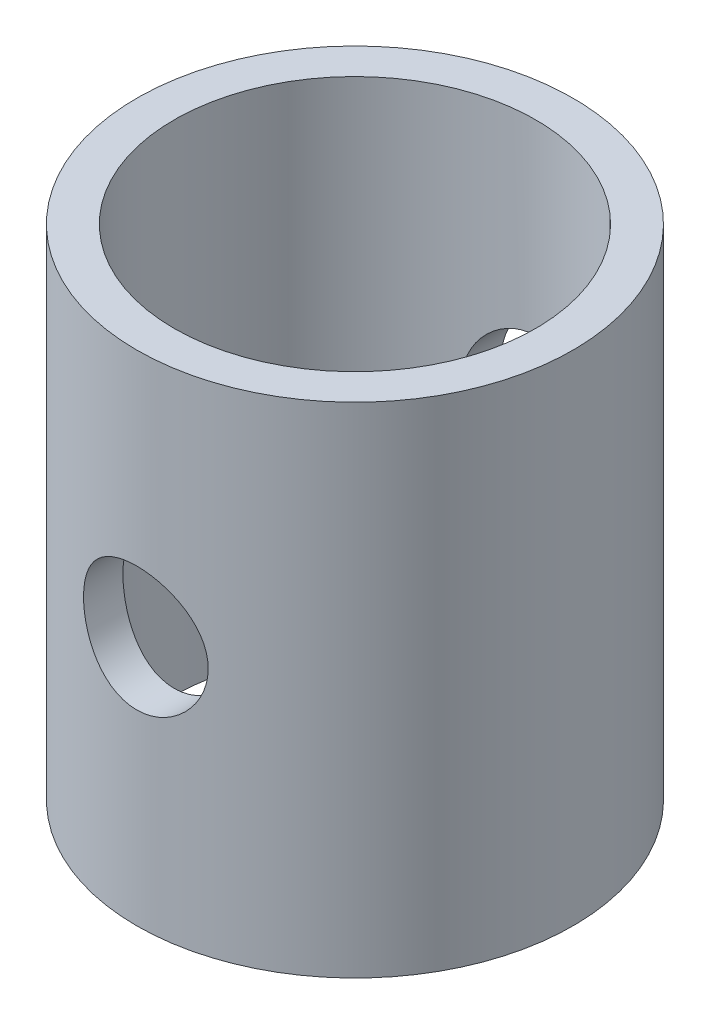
ISO-10303-21;
HEADER;
FILE_DESCRIPTION(('STEP AP214'),'2;1');
FILE_NAME('part.step','',(''),(''),'','','');
FILE_SCHEMA(('AUTOMOTIVE_DESIGN { 1 0 10303 214 1 1 1 1 }'));
ENDSEC;
DATA;
#1=APPLICATION_CONTEXT('core data for automotive mechanical design processes');
#2=APPLICATION_PROTOCOL_DEFINITION('international standard','automotive_design',2000,#1);
#3=PRODUCT_CONTEXT('',#1,'mechanical');
#4=PRODUCT('Part','Part','',(#3));
#5=PRODUCT_RELATED_PRODUCT_CATEGORY('part','',(#4));
#6=PRODUCT_DEFINITION_FORMATION('','',#4);
#7=PRODUCT_DEFINITION_CONTEXT('part definition',#1,'design');
#8=PRODUCT_DEFINITION('design','',#6,#7);
#9=PRODUCT_DEFINITION_SHAPE('','',#8);
#10=(LENGTH_UNIT() NAMED_UNIT(*) SI_UNIT(.MILLI.,.METRE.));
#11=(NAMED_UNIT(*) PLANE_ANGLE_UNIT() SI_UNIT($,.RADIAN.));
#12=(NAMED_UNIT(*) SI_UNIT($,.STERADIAN.) SOLID_ANGLE_UNIT());
#13=UNCERTAINTY_MEASURE_WITH_UNIT(LENGTH_MEASURE(1.E-05),#10,'distance_accuracy_value','');
#14=(GEOMETRIC_REPRESENTATION_CONTEXT(3) GLOBAL_UNCERTAINTY_ASSIGNED_CONTEXT((#13)) GLOBAL_UNIT_ASSIGNED_CONTEXT((#10,
#11,#12)) REPRESENTATION_CONTEXT('',''));
#15=CARTESIAN_POINT('',(0.,0.,0.));
#16=DIRECTION('',(0.,0.,1.));
#17=DIRECTION('',(1.,0.,0.));
#18=AXIS2_PLACEMENT_3D('',#15,#16,#17);
#19=CARTESIAN_POINT('',(0.,20.,0.));
#20=DIRECTION('',(0.,1.,0.));
#21=DIRECTION('',(0.,0.,1.));
#22=AXIS2_PLACEMENT_3D('',#19,#20,#21);
#23=PLANE('',#22);
#24=CARTESIAN_POINT('',(0.,20.,0.));
#25=DIRECTION('',(0.,1.,0.));
#26=DIRECTION('',(0.,0.,1.));
#27=AXIS2_PLACEMENT_3D('',#24,#25,#26);
#28=CIRCLE('',#27,17.5);
#29=CARTESIAN_POINT('',(0.,20.,17.5));
#30=VERTEX_POINT('',#29);
#31=EDGE_CURVE('E10',#30,#30,#28,.T.);
#32=ORIENTED_EDGE('',*,*,#31,.T.);
#33=EDGE_LOOP('',(#32));
#34=FACE_BOUND('',#33,.T.);
#35=CARTESIAN_POINT('',(0.,20.,0.));
#36=DIRECTION('',(0.,1.,0.));
#37=DIRECTION('',(0.,0.,1.));
#38=AXIS2_PLACEMENT_3D('',#35,#36,#37);
#39=CIRCLE('',#38,14.5);
#40=CARTESIAN_POINT('',(0.,20.,14.5));
#41=VERTEX_POINT('',#40);
#42=EDGE_CURVE('E49',#41,#41,#39,.T.);
#43=ORIENTED_EDGE('',*,*,#42,.F.);
#44=EDGE_LOOP('',(#43));
#45=FACE_BOUND('',#44,.T.);
#46=ADVANCED_FACE('F31',(#34,#45),#23,.T.);
#47=CARTESIAN_POINT('',(0.,-20.,0.));
#48=DIRECTION('',(0.,1.,0.));
#49=DIRECTION('',(0.,0.,1.));
#50=AXIS2_PLACEMENT_3D('',#47,#48,#49);
#51=PLANE('',#50);
#52=CARTESIAN_POINT('',(0.,-20.,0.));
#53=DIRECTION('',(0.,1.,0.));
#54=DIRECTION('',(0.,0.,1.));
#55=AXIS2_PLACEMENT_3D('',#52,#53,#54);
#56=CIRCLE('',#55,17.5);
#57=CARTESIAN_POINT('',(0.,-20.,17.5));
#58=VERTEX_POINT('',#57);
#59=EDGE_CURVE('E44',#58,#58,#56,.T.);
#60=ORIENTED_EDGE('',*,*,#59,.F.);
#61=EDGE_LOOP('',(#60));
#62=FACE_BOUND('',#61,.T.);
#63=CARTESIAN_POINT('',(0.,-20.,0.));
#64=DIRECTION('',(0.,1.,0.));
#65=DIRECTION('',(0.,0.,1.));
#66=AXIS2_PLACEMENT_3D('',#63,#64,#65);
#67=CIRCLE('',#66,14.5);
#68=CARTESIAN_POINT('',(0.,-20.,14.5));
#69=VERTEX_POINT('',#68);
#70=EDGE_CURVE('E78',#69,#69,#67,.T.);
#71=ORIENTED_EDGE('',*,*,#70,.T.);
#72=EDGE_LOOP('',(#71));
#73=FACE_BOUND('',#72,.T.);
#74=ADVANCED_FACE('F86',(#62,#73),#51,.F.);
#75=CARTESIAN_POINT('',(0.,20.,0.));
#76=DIRECTION('',(0.,-1.,0.));
#77=DIRECTION('',(0.,0.,-1.));
#78=AXIS2_PLACEMENT_3D('',#75,#76,#77);
#79=CYLINDRICAL_SURFACE('',#78,17.5);
#80=CARTESIAN_POINT('',(0.,5.,-17.5));
#81=CARTESIAN_POINT('',(-0.274887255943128,4.99999515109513,-17.4999967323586));
#82=CARTESIAN_POINT('',(-0.549824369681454,4.97725552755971,-17.4934604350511));
#83=CARTESIAN_POINT('',(-1.09172997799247,4.88708932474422,-17.4680226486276));
#84=CARTESIAN_POINT('',(-1.35869541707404,4.81964583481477,-17.4491164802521));
#85=CARTESIAN_POINT('',(-1.87676075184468,4.64247990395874,-17.4010172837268));
#86=CARTESIAN_POINT('',(-2.12788220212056,4.53281640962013,-17.3718386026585));
#87=CARTESIAN_POINT('',(-2.60817190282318,4.27455502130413,-17.3062494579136));
#88=CARTESIAN_POINT('',(-2.83733785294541,4.12595305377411,-17.2698382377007));
#89=CARTESIAN_POINT('',(-3.27323611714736,3.78991247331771,-17.1926183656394));
#90=CARTESIAN_POINT('',(-3.47930930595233,3.6016381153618,-17.1517260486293));
#91=CARTESIAN_POINT('',(-3.85742839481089,3.19338064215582,-17.0706683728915));
#92=CARTESIAN_POINT('',(-4.02946919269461,2.97339278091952,-17.0305031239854));
#93=CARTESIAN_POINT('',(-4.3379947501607,2.50251604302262,-16.9545753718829));
#94=CARTESIAN_POINT('',(-4.47369552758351,2.25109503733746,-16.9189175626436));
#95=CARTESIAN_POINT('',(-4.7006292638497,1.72781997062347,-16.8572835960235));
#96=CARTESIAN_POINT('',(-4.79187178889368,1.4559703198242,-16.8313053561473));
#97=CARTESIAN_POINT('',(-4.92496082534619,0.906913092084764,-16.7928402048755));
#98=CARTESIAN_POINT('',(-4.9680138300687,0.630021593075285,-16.7800244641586));
#99=CARTESIAN_POINT('',(-5.00726669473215,0.0726721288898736,-16.7683552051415));
#100=CARTESIAN_POINT('',(-5.00347673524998,-0.207785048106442,-16.769498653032));
#101=CARTESIAN_POINT('',(-4.95010336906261,-0.754671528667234,-16.7853258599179));
#102=CARTESIAN_POINT('',(-4.90200814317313,-1.0212608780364,-16.7995695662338));
#103=CARTESIAN_POINT('',(-4.76378465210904,-1.5424180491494,-16.8392837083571));
#104=CARTESIAN_POINT('',(-4.67365258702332,-1.79698478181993,-16.8647551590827));
#105=CARTESIAN_POINT('',(-4.45276702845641,-2.29061561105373,-16.9244215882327));
#106=CARTESIAN_POINT('',(-4.32151377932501,-2.52944268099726,-16.95872291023));
#107=CARTESIAN_POINT('',(-4.02245947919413,-2.98219140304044,-17.0321304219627));
#108=CARTESIAN_POINT('',(-3.85465029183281,-3.19610749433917,-17.0712376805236));
#109=CARTESIAN_POINT('',(-3.47975999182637,-3.60143093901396,-17.151656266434));
#110=CARTESIAN_POINT('',(-3.27143718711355,-3.79168618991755,-17.1929951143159));
#111=CARTESIAN_POINT('',(-2.82533070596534,-4.13481500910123,-17.2719061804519));
#112=CARTESIAN_POINT('',(-2.58754550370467,-4.28768664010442,-17.3094782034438));
#113=CARTESIAN_POINT('',(-2.08730768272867,-4.55232183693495,-17.3769132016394));
#114=CARTESIAN_POINT('',(-1.82472454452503,-4.66385071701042,-17.4067318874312));
#115=CARTESIAN_POINT('',(-1.28348307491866,-4.8408347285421,-17.4549812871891));
#116=CARTESIAN_POINT('',(-1.00482881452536,-4.90630147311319,-17.4734148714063));
#117=CARTESIAN_POINT('',(-0.449165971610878,-4.98743321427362,-17.4963718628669));
#118=CARTESIAN_POINT('',(-0.17240336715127,-5.00466173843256,-17.501331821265));
#119=CARTESIAN_POINT('',(0.380066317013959,-4.9931818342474,-17.4980521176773));
#120=CARTESIAN_POINT('',(0.655773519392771,-4.9644789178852,-17.4898140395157));
#121=CARTESIAN_POINT('',(1.19254658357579,-4.86322388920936,-17.4613481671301));
#122=CARTESIAN_POINT('',(1.45379552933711,-4.79156704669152,-17.4413653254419));
#123=CARTESIAN_POINT('',(1.9605217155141,-4.60749874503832,-17.3916999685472));
#124=CARTESIAN_POINT('',(2.20599712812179,-4.49508257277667,-17.3620163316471));
#125=CARTESIAN_POINT('',(2.68010421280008,-4.22994165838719,-17.2952490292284));
#126=CARTESIAN_POINT('',(2.90825621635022,-4.07639700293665,-17.2580190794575));
#127=CARTESIAN_POINT('',(3.33609632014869,-3.73436873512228,-17.180448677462));
#128=CARTESIAN_POINT('',(3.53577792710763,-3.54587717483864,-17.1401075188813));
#129=CARTESIAN_POINT('',(3.90776607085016,-3.13197664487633,-17.0592154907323));
#130=CARTESIAN_POINT('',(4.07896356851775,-2.90556181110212,-17.0187009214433));
#131=CARTESIAN_POINT('',(4.380988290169,-2.42634352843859,-16.9434723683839));
#132=CARTESIAN_POINT('',(4.51181691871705,-2.17354099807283,-16.9087581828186));
#133=CARTESIAN_POINT('',(4.72843635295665,-1.64977197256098,-16.8494662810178));
#134=CARTESIAN_POINT('',(4.81446583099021,-1.37891059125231,-16.8248350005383));
#135=CARTESIAN_POINT('',(4.93948625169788,-0.825725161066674,-16.7885614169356));
#136=CARTESIAN_POINT('',(4.9784914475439,-0.543404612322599,-16.7769151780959));
#137=CARTESIAN_POINT('',(5.00745060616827,0.0132400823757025,-16.7682925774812));
#138=CARTESIAN_POINT('',(4.99920069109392,0.287463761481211,-16.7707790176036));
#139=CARTESIAN_POINT('',(4.93811777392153,0.830436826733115,-16.7888649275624));
#140=CARTESIAN_POINT('',(4.88528625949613,1.09918639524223,-16.8044639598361));
#141=CARTESIAN_POINT('',(4.73764922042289,1.6209459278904,-16.8466744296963));
#142=CARTESIAN_POINT('',(4.64327729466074,1.87408846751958,-16.8731719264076));
#143=CARTESIAN_POINT('',(4.41557373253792,2.36114683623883,-16.9341825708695));
#144=CARTESIAN_POINT('',(4.28223520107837,2.59505925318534,-16.9686971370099));
#145=CARTESIAN_POINT('',(3.97516366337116,3.04545880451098,-17.0432917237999));
#146=CARTESIAN_POINT('',(3.80023069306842,3.26110347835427,-17.0835190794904));
#147=CARTESIAN_POINT('',(3.41714960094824,3.66055973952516,-17.164246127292));
#148=CARTESIAN_POINT('',(3.20899312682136,3.84436329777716,-17.2047458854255));
#149=CARTESIAN_POINT('',(2.75893580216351,4.17959296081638,-17.282698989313));
#150=CARTESIAN_POINT('',(2.51630625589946,4.33006746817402,-17.3200475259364));
#151=CARTESIAN_POINT('',(2.00812632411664,4.58786446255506,-17.3862848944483));
#152=CARTESIAN_POINT('',(1.74258856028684,4.69521052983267,-17.4151783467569));
#153=CARTESIAN_POINT('',(1.23229078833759,4.85211887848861,-17.4581836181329));
#154=CARTESIAN_POINT('',(0.989407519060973,4.9074338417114,-17.473742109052));
#155=CARTESIAN_POINT('',(0.497695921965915,4.98137414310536,-17.4946510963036));
#156=CARTESIAN_POINT('',(0.248868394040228,5.00000438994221,-17.5000029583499));
#157=CARTESIAN_POINT('',(0.,5.,-17.5));
#158=B_SPLINE_CURVE_WITH_KNOTS('',3,(#80,#81,#82,#83,#84,#85,#86,#87,#88,#89,#90,#91,#92,#93,
#94,#95,#96,#97,#98,#99,#100,#101,#102,#103,#104,#105,#106,#107,#108,#109,#110,#111,#112,#113,
#114,#115,#116,#117,#118,#119,#120,#121,#122,#123,#124,#125,#126,#127,#128,#129,#130,#131,#132,
#133,#134,#135,#136,#137,#138,#139,#140,#141,#142,#143,#144,#145,#146,#147,#148,#149,#150,#151,
#152,#153,#154,#155,#156,#157),.UNSPECIFIED.,.T.,.F.,(4,2,2,2,2,2,2,2,2,2,2,2,2,2,2,2,2,2,2,2,2,
2,2,2,2,2,2,2,2,2,2,2,2,2,2,2,2,2,4),(0.,0.82374828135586,1.64780834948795,2.47072203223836,
3.2937218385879,4.13619528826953,4.97879494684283,5.83832688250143,6.69767378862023,
7.53498774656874,8.37211973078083,9.18211964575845,9.99219279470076,10.8125200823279,
11.6330301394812,12.4844625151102,13.3359390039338,14.1921775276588,15.0482001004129,
15.8761364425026,16.7039734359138,17.5151285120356,18.3263774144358,19.1551881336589,
19.9841875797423,20.840302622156,21.6963878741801,22.5478643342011,23.399082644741,
24.2181670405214,25.0372241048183,25.8479274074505,26.6587742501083,27.4966914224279,
28.3348195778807,29.1944494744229,30.053608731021,30.7994867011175,31.5452648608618),.UNSPECIFIED.);
#159=CARTESIAN_POINT('',(0.,5.,-17.5));
#160=VERTEX_POINT('',#159);
#161=EDGE_CURVE('E73',#160,#160,#158,.T.);
#162=ORIENTED_EDGE('',*,*,#161,.T.);
#163=EDGE_LOOP('',(#162));
#164=FACE_BOUND('',#163,.T.);
#165=CARTESIAN_POINT('',(5.,0.,16.7705098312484));
#166=CARTESIAN_POINT('',(4.99999505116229,-0.274628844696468,16.7705136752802));
#167=CARTESIAN_POINT('',(4.97729666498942,-0.549307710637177,16.7773294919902));
#168=CARTESIAN_POINT('',(4.88730908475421,-1.09067809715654,16.8037597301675));
#169=CARTESIAN_POINT('',(4.82000175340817,-1.35736632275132,16.8233793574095));
#170=CARTESIAN_POINT('',(4.64323358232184,-1.87484300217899,16.8730177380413));
#171=CARTESIAN_POINT('',(4.5338380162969,-2.12565537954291,16.903020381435));
#172=CARTESIAN_POINT('',(4.27620910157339,-2.60541952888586,16.9700230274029));
#173=CARTESIAN_POINT('',(4.12797114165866,-2.83436870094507,17.0070238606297));
#174=CARTESIAN_POINT('',(3.79231200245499,-3.2704789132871,17.0850445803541));
#175=CARTESIAN_POINT('',(3.60397302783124,-3.47691950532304,17.1261438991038));
#176=CARTESIAN_POINT('',(3.19542811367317,-3.85575695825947,17.2070491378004));
#177=CARTESIAN_POINT('',(2.97521844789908,-4.0281498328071,17.2468549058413));
#178=CARTESIAN_POINT('',(2.50411508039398,-4.33707162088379,17.3215833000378));
#179=CARTESIAN_POINT('',(2.25272695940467,-4.47287404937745,17.3564013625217));
#180=CARTESIAN_POINT('',(1.7295211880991,-4.70000443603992,17.4163135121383));
#181=CARTESIAN_POINT('',(1.45770752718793,-4.79134105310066,17.4414094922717));
#182=CARTESIAN_POINT('',(0.908896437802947,-4.92458615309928,17.4784879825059));
#183=CARTESIAN_POINT('',(0.632219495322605,-4.96772255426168,17.4907956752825));
#184=CARTESIAN_POINT('',(0.0753002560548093,-5.00721683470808,17.5020523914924));
#185=CARTESIAN_POINT('',(-0.204941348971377,-5.00358365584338,17.5010039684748));
#186=CARTESIAN_POINT('',(-0.752450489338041,-4.95048406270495,17.4859001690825));
#187=CARTESIAN_POINT('',(-1.01985886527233,-4.9023459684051,17.4722217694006));
#188=CARTESIAN_POINT('',(-1.54263055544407,-4.76376224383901,17.4338471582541));
#189=CARTESIAN_POINT('',(-1.79799313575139,-4.67331403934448,17.4091502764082));
#190=CARTESIAN_POINT('',(-2.29268458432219,-4.45172649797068,17.3509757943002));
#191=CARTESIAN_POINT('',(-2.53180760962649,-4.32015305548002,17.3174051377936));
#192=CARTESIAN_POINT('',(-2.98501810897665,-4.02038853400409,17.2450692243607));
#193=CARTESIAN_POINT('',(-3.19910008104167,-3.85218943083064,17.206302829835));
#194=CARTESIAN_POINT('',(-3.60408162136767,-3.47698572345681,17.126142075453));
#195=CARTESIAN_POINT('',(-3.79390394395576,-3.26882641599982,17.0847032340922));
#196=CARTESIAN_POINT('',(-4.13623253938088,-2.82321227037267,17.0050743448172));
#197=CARTESIAN_POINT('',(-4.28873578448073,-2.58575505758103,16.9668845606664));
#198=CARTESIAN_POINT('',(-4.55308339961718,-2.08567278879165,16.8978793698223));
#199=CARTESIAN_POINT('',(-4.66459344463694,-1.82286193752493,16.8671252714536));
#200=CARTESIAN_POINT('',(-4.84147378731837,-1.28111709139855,16.8172136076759));
#201=CARTESIAN_POINT('',(-4.90685751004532,-1.00218781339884,16.7980526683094));
#202=CARTESIAN_POINT('',(-4.9876854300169,-0.446298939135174,16.7742278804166));
#203=CARTESIAN_POINT('',(-5.00475370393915,-0.169595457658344,16.7690927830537));
#204=CARTESIAN_POINT('',(-4.99297491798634,0.382720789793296,16.772603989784));
#205=CARTESIAN_POINT('',(-4.96413358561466,0.658333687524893,16.7812485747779));
#206=CARTESIAN_POINT('',(-4.86279453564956,1.19410307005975,16.8108857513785));
#207=CARTESIAN_POINT('',(-4.79131155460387,1.45446896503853,16.8315910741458));
#208=CARTESIAN_POINT('',(-4.60787904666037,1.95950467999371,16.8827265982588));
#209=CARTESIAN_POINT('',(-4.4959236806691,2.20417222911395,16.9131582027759));
#210=CARTESIAN_POINT('',(-4.23154912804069,2.67755518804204,16.9812547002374));
#211=CARTESIAN_POINT('',(-4.07819729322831,2.90572611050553,17.0190799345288));
#212=CARTESIAN_POINT('',(-3.73651159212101,3.33369093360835,17.0973431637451));
#213=CARTESIAN_POINT('',(-3.54817014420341,3.53347866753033,17.1377817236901));
#214=CARTESIAN_POINT('',(-3.1342700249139,3.90594854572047,17.2183681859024));
#215=CARTESIAN_POINT('',(-2.90766927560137,4.07748742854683,17.2584601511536));
#216=CARTESIAN_POINT('',(-2.42796326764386,4.38011420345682,17.3324494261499));
#217=CARTESIAN_POINT('',(-2.17485939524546,4.51120420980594,17.3663470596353));
#218=CARTESIAN_POINT('',(-1.65108318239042,4.72796071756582,17.4239126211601));
#219=CARTESIAN_POINT('',(-1.38056199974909,4.8139709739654,17.4476577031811));
#220=CARTESIAN_POINT('',(-0.828114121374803,4.93906700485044,17.4825834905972));
#221=CARTESIAN_POINT('',(-0.546190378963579,4.97816485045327,17.4937674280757));
#222=CARTESIAN_POINT('',(0.0104455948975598,5.00747858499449,17.5021333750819));
#223=CARTESIAN_POINT('',(0.285064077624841,4.99936037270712,17.4997925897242));
#224=CARTESIAN_POINT('',(0.828862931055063,4.9384042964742,17.4824767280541));
#225=CARTESIAN_POINT('',(1.09804356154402,4.88556857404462,17.4675022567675));
#226=CARTESIAN_POINT('',(1.62101033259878,4.73767159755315,17.4267200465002));
#227=CARTESIAN_POINT('',(1.87491258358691,4.64299205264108,17.4010103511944));
#228=CARTESIAN_POINT('',(2.36336800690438,4.41443460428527,17.3414273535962));
#229=CARTESIAN_POINT('',(2.59791817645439,4.28055063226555,17.3075527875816));
#230=CARTESIAN_POINT('',(3.04858364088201,3.97275665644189,17.2339738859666));
#231=CARTESIAN_POINT('',(3.26394332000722,3.79777478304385,17.1941261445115));
#232=CARTESIAN_POINT('',(3.66280305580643,3.41472718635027,17.1136016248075));
#233=CARTESIAN_POINT('',(3.8462942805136,3.20665232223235,17.072924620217));
#234=CARTESIAN_POINT('',(4.18102115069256,2.75675770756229,16.9941009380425));
#235=CARTESIAN_POINT('',(4.33128291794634,2.51419513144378,16.9560487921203));
#236=CARTESIAN_POINT('',(4.58869859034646,2.00619533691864,16.8882111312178));
#237=CARTESIAN_POINT('',(4.69587662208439,1.74077102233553,16.8584209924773));
#238=CARTESIAN_POINT('',(4.85246335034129,1.23086574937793,16.8139614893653));
#239=CARTESIAN_POINT('',(4.90764749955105,0.988274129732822,16.7978109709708));
#240=CARTESIAN_POINT('',(4.98141517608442,0.497134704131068,16.776084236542));
#241=CARTESIAN_POINT('',(5.00000447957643,0.248587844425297,16.7705063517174));
#242=CARTESIAN_POINT('',(5.,0.,16.7705098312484));
#243=B_SPLINE_CURVE_WITH_KNOTS('',3,(#165,#166,#167,#168,#169,#170,#171,#172,#173,#174,#175,
#176,#177,#178,#179,#180,#181,#182,#183,#184,#185,#186,#187,#188,#189,#190,#191,#192,#193,#194,
#195,#196,#197,#198,#199,#200,#201,#202,#203,#204,#205,#206,#207,#208,#209,#210,#211,#212,#213,
#214,#215,#216,#217,#218,#219,#220,#221,#222,#223,#224,#225,#226,#227,#228,#229,#230,#231,#232,
#233,#234,#235,#236,#237,#238,#239,#240,#241,#242),.UNSPECIFIED.,.T.,.F.,(4,2,2,2,2,2,2,2,2,2,2,
2,2,2,2,2,2,2,2,2,2,2,2,2,2,2,2,2,2,2,2,2,2,2,2,2,2,2,4),(0.,0.822970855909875,1.64627652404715,
2.46831045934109,3.29044202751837,4.13392918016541,4.97751503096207,5.83678707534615,
6.69589172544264,7.53257252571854,8.36909336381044,9.18142594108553,9.99380794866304,
10.8150725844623,11.6365173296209,12.486790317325,13.337132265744,14.194263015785,
15.0511441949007,15.8788590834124,16.7064707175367,17.5151322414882,18.3239104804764,
19.152700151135,19.981669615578,20.8386347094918,21.6955550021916,22.5458421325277,
23.3959104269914,24.2161724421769,25.0363951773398,25.8492853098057,26.662301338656,
27.4994942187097,28.3369187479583,29.1963403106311,30.0552799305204,30.8003322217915,
31.5452669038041),.UNSPECIFIED.);
#244=CARTESIAN_POINT('',(5.,0.,16.7705098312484));
#245=VERTEX_POINT('',#244);
#246=EDGE_CURVE('E69',#245,#245,#243,.T.);
#247=ORIENTED_EDGE('',*,*,#246,.T.);
#248=EDGE_LOOP('',(#247));
#249=FACE_BOUND('',#248,.T.);
#250=ORIENTED_EDGE('',*,*,#31,.F.);
#251=EDGE_LOOP('',(#250));
#252=FACE_BOUND('',#251,.T.);
#253=ORIENTED_EDGE('',*,*,#59,.T.);
#254=EDGE_LOOP('',(#253));
#255=FACE_BOUND('',#254,.T.);
#256=ADVANCED_FACE('F33',(#164,#249,#252,#255),#79,.T.);
#257=CARTESIAN_POINT('',(0.,20.,0.));
#258=DIRECTION('',(0.,-1.,0.));
#259=DIRECTION('',(0.,0.,-1.));
#260=AXIS2_PLACEMENT_3D('',#257,#258,#259);
#261=CYLINDRICAL_SURFACE('',#260,14.5);
#262=CARTESIAN_POINT('',(0.,5.,-14.5));
#263=CARTESIAN_POINT('',(-0.272276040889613,5.00000332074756,-14.5000022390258));
#264=CARTESIAN_POINT('',(-0.544528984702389,4.97768822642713,-14.4922612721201));
#265=CARTESIAN_POINT('',(-1.08098398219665,4.88931271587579,-14.4621461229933));
#266=CARTESIAN_POINT('',(-1.34518575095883,4.82325075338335,-14.4397714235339));
#267=CARTESIAN_POINT('',(-1.85772547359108,4.64994088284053,-14.3828127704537));
#268=CARTESIAN_POINT('',(-2.10609017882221,4.54276469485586,-14.3482500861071));
#269=CARTESIAN_POINT('',(-2.58131962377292,4.29059193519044,-14.2704184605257));
#270=CARTESIAN_POINT('',(-2.80817965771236,4.14558711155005,-14.2271476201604));
#271=CARTESIAN_POINT('',(-3.24227336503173,3.81632850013,-14.1346589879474));
#272=CARTESIAN_POINT('',(-3.44860772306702,3.63093347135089,-14.0852916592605));
#273=CARTESIAN_POINT('',(-3.82802367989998,3.22841309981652,-13.986947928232));
#274=CARTESIAN_POINT('',(-4.00109725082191,3.01128011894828,-13.9379716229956));
#275=CARTESIAN_POINT('',(-4.23466620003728,2.66234731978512,-13.8681109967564));
#276=CARTESIAN_POINT('',(-4.3091147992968,2.54009073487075,-13.8451000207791));
#277=CARTESIAN_POINT('',(-4.44739544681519,2.28935315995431,-13.8013017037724));
#278=CARTESIAN_POINT('',(-4.51123171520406,2.16087467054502,-13.7805134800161));
#279=CARTESIAN_POINT('',(-4.62776638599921,1.89852352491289,-13.7418177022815));
#280=CARTESIAN_POINT('',(-4.68046298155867,1.76464999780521,-13.7239106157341));
#281=CARTESIAN_POINT('',(-4.7742048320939,1.49253537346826,-13.6915823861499));
#282=CARTESIAN_POINT('',(-4.81525547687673,1.35429632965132,-13.6771596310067));
#283=CARTESIAN_POINT('',(-4.88408382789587,1.07939281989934,-13.652729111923));
#284=CARTESIAN_POINT('',(-4.91227899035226,0.94284508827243,-13.642583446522));
#285=CARTESIAN_POINT('',(-4.95717772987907,0.667690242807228,-13.626333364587));
#286=CARTESIAN_POINT('',(-4.97388615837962,0.529084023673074,-13.6202272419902));
#287=CARTESIAN_POINT('',(-4.99565258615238,0.250850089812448,-13.6122588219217));
#288=CARTESIAN_POINT('',(-5.00071162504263,0.11122246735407,-13.6103961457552));
#289=CARTESIAN_POINT('',(-4.99912744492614,-0.167954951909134,-13.6109781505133));
#290=CARTESIAN_POINT('',(-4.99248458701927,-0.307504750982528,-13.6134226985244));
#291=CARTESIAN_POINT('',(-4.96818839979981,-0.578520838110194,-13.6223074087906));
#292=CARTESIAN_POINT('',(-4.95109761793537,-0.710044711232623,-13.6285433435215));
#293=CARTESIAN_POINT('',(-4.9065692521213,-0.971146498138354,-13.6446376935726));
#294=CARTESIAN_POINT('',(-4.87912819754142,-1.10072374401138,-13.654497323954));
#295=CARTESIAN_POINT('',(-4.81415116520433,-1.35698559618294,-13.6775412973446));
#296=CARTESIAN_POINT('',(-4.77661796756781,-1.48367098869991,-13.6907247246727));
#297=CARTESIAN_POINT('',(-4.69177720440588,-1.73339178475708,-13.72003033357));
#298=CARTESIAN_POINT('',(-4.6444659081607,-1.85642577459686,-13.7361536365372));
#299=CARTESIAN_POINT('',(-4.48666214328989,-2.22288958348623,-13.7888490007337));
#300=CARTESIAN_POINT('',(-4.36134524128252,-2.45956912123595,-13.8293558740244));
#301=CARTESIAN_POINT('',(-4.07532115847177,-2.90910484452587,-13.9163223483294));
#302=CARTESIAN_POINT('',(-3.91460319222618,-3.12195373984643,-13.9627837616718));
#303=CARTESIAN_POINT('',(-3.55164087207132,-3.53052058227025,-14.0596232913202));
#304=CARTESIAN_POINT('',(-3.34757212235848,-3.72460659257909,-14.1100748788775));
#305=CARTESIAN_POINT('',(-2.90917503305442,-4.07623406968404,-14.2069361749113));
#306=CARTESIAN_POINT('',(-2.67484337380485,-4.23377152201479,-14.2533454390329));
#307=CARTESIAN_POINT('',(-2.17891773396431,-4.50928356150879,-14.3375798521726));
#308=CARTESIAN_POINT('',(-1.91704633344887,-4.62679239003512,-14.3753023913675));
#309=CARTESIAN_POINT('',(-1.37563712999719,-4.81557149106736,-14.437164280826));
#310=CARTESIAN_POINT('',(-1.09610595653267,-4.88685900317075,-14.4613086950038));
#311=CARTESIAN_POINT('',(-0.541123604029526,-4.97821338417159,-14.4924414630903));
#312=CARTESIAN_POINT('',(-0.266076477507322,-5.00048606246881,-14.5001680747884));
#313=CARTESIAN_POINT('',(0.283897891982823,-4.99949805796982,-14.4998264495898));
#314=CARTESIAN_POINT('',(0.558825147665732,-4.97624567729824,-14.4917610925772));
#315=CARTESIAN_POINT('',(1.0917393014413,-4.88659915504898,-14.4612301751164));
#316=CARTESIAN_POINT('',(1.34998705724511,-4.82158289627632,-14.4392248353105));
#317=CARTESIAN_POINT('',(1.85179161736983,-4.65199157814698,-14.3834851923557));
#318=CARTESIAN_POINT('',(2.09534652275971,-4.54741141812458,-14.3497493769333));
#319=CARTESIAN_POINT('',(2.56823537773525,-4.29855141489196,-14.2728125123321));
#320=CARTESIAN_POINT('',(2.79700047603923,-4.15326682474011,-14.2293784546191));
#321=CARTESIAN_POINT('',(3.22769174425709,-3.82815432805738,-14.13791051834));
#322=CARTESIAN_POINT('',(3.42960918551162,-3.64831523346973,-14.0898751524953));
#323=CARTESIAN_POINT('',(3.71327334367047,-3.35136348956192,-14.0168405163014));
#324=CARTESIAN_POINT('',(3.80653976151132,-3.24503766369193,-13.9917382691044));
#325=CARTESIAN_POINT('',(3.98380499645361,-3.02477322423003,-13.9423006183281));
#326=CARTESIAN_POINT('',(4.067807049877,-2.91083729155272,-13.9179649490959));
#327=CARTESIAN_POINT('',(4.2260045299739,-2.67599450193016,-13.8707501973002));
#328=CARTESIAN_POINT('',(4.30019554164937,-2.55508454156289,-13.8478717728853));
#329=CARTESIAN_POINT('',(4.43815222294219,-2.3071452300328,-13.8042760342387));
#330=CARTESIAN_POINT('',(4.50192226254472,-2.1801184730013,-13.783557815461));
#331=CARTESIAN_POINT('',(4.61853752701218,-1.92076109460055,-13.7449222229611));
#332=CARTESIAN_POINT('',(4.67138490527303,-1.78843152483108,-13.727004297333));
#333=CARTESIAN_POINT('',(4.76567488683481,-1.51942314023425,-13.6945547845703));
#334=CARTESIAN_POINT('',(4.80712221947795,-1.38274615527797,-13.6800217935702));
#335=CARTESIAN_POINT('',(4.87822592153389,-1.10603494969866,-13.6548283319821));
#336=CARTESIAN_POINT('',(4.9078846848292,-0.966001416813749,-13.6441670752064));
#337=CARTESIAN_POINT('',(4.95510828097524,-0.683656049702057,-13.6270883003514));
#338=CARTESIAN_POINT('',(4.97267378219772,-0.541344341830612,-13.6206705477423));
#339=CARTESIAN_POINT('',(4.99488920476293,-0.263484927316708,-13.6125387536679));
#340=CARTESIAN_POINT('',(5.00019728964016,-0.127996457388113,-13.610585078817));
#341=CARTESIAN_POINT('',(4.99979144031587,0.14300985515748,-13.6107342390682));
#342=CARTESIAN_POINT('',(4.99407376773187,0.278527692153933,-13.6128384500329));
#343=CARTESIAN_POINT('',(4.97167135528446,0.548469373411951,-13.6210361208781));
#344=CARTESIAN_POINT('',(4.95499149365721,0.682893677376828,-13.627127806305));
#345=CARTESIAN_POINT('',(4.91082799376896,0.949774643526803,-13.6431051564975));
#346=CARTESIAN_POINT('',(4.8833402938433,1.08223054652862,-13.6529922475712));
#347=CARTESIAN_POINT('',(4.81854500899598,1.34128566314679,-13.6759927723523));
#348=CARTESIAN_POINT('',(4.7814691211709,1.46794961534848,-13.6890296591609));
#349=CARTESIAN_POINT('',(4.69755188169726,1.71766819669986,-13.7180526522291));
#350=CARTESIAN_POINT('',(4.65070706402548,1.84072152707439,-13.7340398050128));
#351=CARTESIAN_POINT('',(4.49605471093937,2.20327052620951,-13.7857669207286));
#352=CARTESIAN_POINT('',(4.37407833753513,2.43635717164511,-13.8252915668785));
#353=CARTESIAN_POINT('',(4.08941820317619,2.88993431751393,-13.9122148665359));
#354=CARTESIAN_POINT('',(3.92511672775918,3.10934839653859,-13.9598925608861));
#355=CARTESIAN_POINT('',(3.56309439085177,3.51837325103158,-14.0566506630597));
#356=CARTESIAN_POINT('',(3.3653637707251,3.70797529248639,-14.1057314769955));
#357=CARTESIAN_POINT('',(2.9319584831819,4.06015625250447,-14.2022852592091));
#358=CARTESIAN_POINT('',(2.69502183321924,4.22123087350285,-14.2495994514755));
#359=CARTESIAN_POINT('',(2.19584251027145,4.50112236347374,-14.3350021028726));
#360=CARTESIAN_POINT('',(1.93360420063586,4.61994650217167,-14.3730921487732));
#361=CARTESIAN_POINT('',(1.39697646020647,4.80911875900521,-14.4350190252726));
#362=CARTESIAN_POINT('',(1.12297038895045,4.88045583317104,-14.4591451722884));
#363=CARTESIAN_POINT('',(0.565965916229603,4.97588700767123,-14.4916319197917));
#364=CARTESIAN_POINT('',(0.282970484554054,4.9999965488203,-14.4999976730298));
#365=CARTESIAN_POINT('',(0.,5.,-14.5));
#366=B_SPLINE_CURVE_WITH_KNOTS('',3,(#262,#263,#264,#265,#266,#267,#268,#269,#270,#271,#272,
#273,#274,#275,#276,#277,#278,#279,#280,#281,#282,#283,#284,#285,#286,#287,#288,#289,#290,#291,
#292,#293,#294,#295,#296,#297,#298,#299,#300,#301,#302,#303,#304,#305,#306,#307,#308,#309,#310,
#311,#312,#313,#314,#315,#316,#317,#318,#319,#320,#321,#322,#323,#324,#325,#326,#327,#328,#329,
#330,#331,#332,#333,#334,#335,#336,#337,#338,#339,#340,#341,#342,#343,#344,#345,#346,#347,#348,
#349,#350,#351,#352,#353,#354,#355,#356,#357,#358,#359,#360,#361,#362,#363,#364,#365),
.UNSPECIFIED.,.T.,.F.,(4,2,2,2,2,2,2,2,2,2,2,2,2,2,2,2,2,2,2,2,2,2,2,2,2,2,2,2,2,2,2,2,2,2,2,2,
2,2,2,2,2,2,2,2,2,2,2,2,2,2,2,4),(0.,0.815786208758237,1.63160125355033,2.4459996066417,
3.26057576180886,4.10214101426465,4.94390913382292,5.37839784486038,5.81271336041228,
6.24709926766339,6.68128380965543,7.10013852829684,7.51881623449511,7.93745657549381,
8.35608399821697,8.75394443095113,9.15193839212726,9.54982282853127,9.94785935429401,
10.7565641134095,11.5655155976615,12.4198691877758,13.2743165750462,14.1383911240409,
15.0021432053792,15.8261529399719,16.6500124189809,17.4479970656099,18.2460846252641,
19.0659338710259,19.8860490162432,20.316566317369,20.7469327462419,21.1774921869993,
21.6078706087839,22.0381641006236,22.4682788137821,22.8983061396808,23.3283096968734,
23.7346261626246,24.14108041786,24.5473539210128,24.9537802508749,25.3511784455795,
25.7487178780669,26.5431766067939,27.3742687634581,28.2056039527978,29.0725277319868,
29.939302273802,30.7874082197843,31.6352368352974),.UNSPECIFIED.);
#367=CARTESIAN_POINT('',(0.,5.,-14.5));
#368=VERTEX_POINT('',#367);
#369=EDGE_CURVE('E36',#368,#368,#366,.T.);
#370=ORIENTED_EDGE('',*,*,#369,.F.);
#371=EDGE_LOOP('',(#370));
#372=FACE_BOUND('',#371,.T.);
#373=CARTESIAN_POINT('',(5.,0.,13.6106575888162));
#374=CARTESIAN_POINT('',(5.00000019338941,-0.135838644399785,13.6106574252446));
#375=CARTESIAN_POINT('',(4.99445977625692,-0.271674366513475,13.6126966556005));
#376=CARTESIAN_POINT('',(4.97235147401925,-0.542373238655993,13.6207877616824));
#377=CARTESIAN_POINT('',(4.95577968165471,-0.677236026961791,13.6268410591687));
#378=CARTESIAN_POINT('',(4.91177626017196,-0.944904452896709,13.6427636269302));
#379=CARTESIAN_POINT('',(4.88434789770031,-1.07771069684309,13.6526317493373));
#380=CARTESIAN_POINT('',(4.81888126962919,-1.34041744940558,13.6758761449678));
#381=CARTESIAN_POINT('',(4.78083884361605,-1.47031679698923,13.6892537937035));
#382=CARTESIAN_POINT('',(4.69458959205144,-1.72597106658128,13.7190707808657));
#383=CARTESIAN_POINT('',(4.64640844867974,-1.85173554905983,13.7355023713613));
#384=CARTESIAN_POINT('',(4.54022257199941,-2.09868348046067,13.7709661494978));
#385=CARTESIAN_POINT('',(4.48221417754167,-2.21986520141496,13.7899993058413));
#386=CARTESIAN_POINT('',(4.29409041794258,-2.57537331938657,13.8502038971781));
#387=CARTESIAN_POINT('',(4.14980740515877,-2.80186605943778,13.8945055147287));
#388=CARTESIAN_POINT('',(3.82130509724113,-3.23646785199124,13.9884893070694));
#389=CARTESIAN_POINT('',(3.63577475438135,-3.44354903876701,14.0383120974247));
#390=CARTESIAN_POINT('',(3.23277425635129,-3.82439664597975,14.1365531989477));
#391=CARTESIAN_POINT('',(3.01529856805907,-3.99815728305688,14.1849712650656));
#392=CARTESIAN_POINT('',(2.54704480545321,-4.31210120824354,14.2765883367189));
#393=CARTESIAN_POINT('',(2.29550171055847,-4.45120182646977,14.3196020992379));
#394=CARTESIAN_POINT('',(1.77084513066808,-4.68470663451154,14.3938933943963));
#395=CARTESIAN_POINT('',(1.49773792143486,-4.77912377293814,14.4251743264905));
#396=CARTESIAN_POINT('',(0.948439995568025,-4.91707794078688,14.4714746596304));
#397=CARTESIAN_POINT('',(0.672737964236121,-4.96236961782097,14.4870533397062));
#398=CARTESIAN_POINT('',(0.117236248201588,-5.00637858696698,14.5021850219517));
#399=CARTESIAN_POINT('',(-0.162562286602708,-5.00510870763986,14.5017424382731));
#400=CARTESIAN_POINT('',(-0.705853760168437,-4.95711925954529,14.4852543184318));
#401=CARTESIAN_POINT('',(-0.969538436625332,-4.91230785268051,14.4698638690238));
#402=CARTESIAN_POINT('',(-1.48538562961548,-4.78167728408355,14.426041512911));
#403=CARTESIAN_POINT('',(-1.73754735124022,-4.69585529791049,14.397608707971));
#404=CARTESIAN_POINT('',(-2.22723185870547,-4.48458801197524,14.330087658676));
#405=CARTESIAN_POINT('',(-2.46450910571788,-4.35862003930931,14.2908598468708));
#406=CARTESIAN_POINT('',(-2.91510454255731,-4.07107491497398,14.205802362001));
#407=CARTESIAN_POINT('',(-3.1284157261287,-3.90948739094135,14.1599707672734));
#408=CARTESIAN_POINT('',(-3.53635103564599,-3.54578332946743,14.0637956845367));
#409=CARTESIAN_POINT('',(-3.72950111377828,-3.34204040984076,14.0133411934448));
#410=CARTESIAN_POINT('',(-4.0793905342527,-2.90465561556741,13.9155186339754));
#411=CARTESIAN_POINT('',(-4.23612341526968,-2.67100844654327,13.8681511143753));
#412=CARTESIAN_POINT('',(-4.51096697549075,-2.17547781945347,13.7812325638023));
#413=CARTESIAN_POINT('',(-4.62841097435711,-1.91319831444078,13.7418205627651));
#414=CARTESIAN_POINT('',(-4.81694959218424,-1.37087900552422,13.6768804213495));
#415=CARTESIAN_POINT('',(-4.88806528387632,-1.09084733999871,13.651345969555));
#416=CARTESIAN_POINT('',(-4.9788350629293,-0.535334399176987,13.6184960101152));
#417=CARTESIAN_POINT('',(-5.00079023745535,-0.260277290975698,13.6103666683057));
#418=CARTESIAN_POINT('',(-4.99916661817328,0.289652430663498,13.6109643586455));
#419=CARTESIAN_POINT('',(-4.97559685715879,0.564525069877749,13.6196880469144));
#420=CARTESIAN_POINT('',(-4.88566566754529,1.09547613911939,13.6521932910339));
#421=CARTESIAN_POINT('',(-4.82094905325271,1.35187252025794,13.675395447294));
#422=CARTESIAN_POINT('',(-4.65256001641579,1.85009967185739,13.7335926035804));
#423=CARTESIAN_POINT('',(-4.54888038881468,2.09192773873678,13.768589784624));
#424=CARTESIAN_POINT('',(-4.30158660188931,2.56310298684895,13.8478771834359));
#425=CARTESIAN_POINT('',(-4.15675549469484,2.79176457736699,13.892438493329));
#426=CARTESIAN_POINT('',(-3.83262599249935,3.22236740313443,13.9853265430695));
#427=CARTESIAN_POINT('',(-3.65331675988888,3.4243002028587,14.0336544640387));
#428=CARTESIAN_POINT('',(-3.25424534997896,3.80659042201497,14.1316732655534));
#429=CARTESIAN_POINT('',(-3.03286309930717,3.98527721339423,14.1813041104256));
#430=CARTESIAN_POINT('',(-2.56203123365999,4.30309762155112,14.2738739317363));
#431=CARTESIAN_POINT('',(-2.31258238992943,4.44223232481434,14.3168130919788));
#432=CARTESIAN_POINT('',(-1.79371016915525,4.6757918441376,14.3909970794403));
#433=CARTESIAN_POINT('',(-1.52441575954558,4.770480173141,14.4223105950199));
#434=CARTESIAN_POINT('',(-0.97242216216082,4.91279408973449,14.4700032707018));
#435=CARTESIAN_POINT('',(-0.689728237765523,4.96043799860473,14.4863882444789));
#436=CARTESIAN_POINT('',(-0.134189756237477,5.00557226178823,14.5019086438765));
#437=CARTESIAN_POINT('',(0.138439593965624,5.00545349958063,14.5018663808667));
#438=CARTESIAN_POINT('',(0.679613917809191,4.96102975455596,14.486593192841));
#439=CARTESIAN_POINT('',(0.948159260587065,4.91672878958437,14.4713636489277));
#440=CARTESIAN_POINT('',(1.46870134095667,4.78681731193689,14.4277505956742));
#441=CARTESIAN_POINT('',(1.72090887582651,4.70196429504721,14.3996086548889));
#442=CARTESIAN_POINT('',(2.20759252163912,4.49406075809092,14.3330709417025));
#443=CARTESIAN_POINT('',(2.44206534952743,4.37100318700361,14.294673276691));
#444=CARTESIAN_POINT('',(2.89645108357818,4.08478470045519,14.2097180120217));
#445=CARTESIAN_POINT('',(3.11545582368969,3.92026215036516,14.1629031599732));
#446=CARTESIAN_POINT('',(3.52359846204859,3.55790327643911,14.0669207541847));
#447=CARTESIAN_POINT('',(3.71272645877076,3.36005595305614,14.0177524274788));
#448=CARTESIAN_POINT('',(3.97413710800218,3.03752487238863,13.9450681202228));
#449=CARTESIAN_POINT('',(4.05905401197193,2.92308312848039,13.9205261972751));
#450=CARTESIAN_POINT('',(4.218929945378,2.68717369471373,13.8729079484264));
#451=CARTESIAN_POINT('',(4.29389267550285,2.56570864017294,13.8498310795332));
#452=CARTESIAN_POINT('',(4.43331903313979,2.31648101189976,13.805833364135));
#453=CARTESIAN_POINT('',(4.49777962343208,2.18871663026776,13.7849131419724));
#454=CARTESIAN_POINT('',(4.61562314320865,1.92782196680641,13.7459039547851));
#455=CARTESIAN_POINT('',(4.66901100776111,1.79469410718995,13.7278137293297));
#456=CARTESIAN_POINT('',(4.76323369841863,1.52686715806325,13.6954019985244));
#457=CARTESIAN_POINT('',(4.80431307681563,1.39226291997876,13.6810080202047));
#458=CARTESIAN_POINT('',(4.87502415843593,1.11979414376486,13.6559711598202));
#459=CARTESIAN_POINT('',(4.90466068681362,0.981931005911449,13.645326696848));
#460=CARTESIAN_POINT('',(4.95220310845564,0.703962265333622,13.628144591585));
#461=CARTESIAN_POINT('',(4.97011072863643,0.563856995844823,13.6216063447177));
#462=CARTESIAN_POINT('',(4.99400888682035,0.282500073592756,13.6128629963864));
#463=CARTESIAN_POINT('',(4.9999997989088,0.141248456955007,13.6106577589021));
#464=CARTESIAN_POINT('',(5.,0.,13.6106575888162));
#465=B_SPLINE_CURVE_WITH_KNOTS('',3,(#373,#374,#375,#376,#377,#378,#379,#380,#381,#382,#383,
#384,#385,#386,#387,#388,#389,#390,#391,#392,#393,#394,#395,#396,#397,#398,#399,#400,#401,#402,
#403,#404,#405,#406,#407,#408,#409,#410,#411,#412,#413,#414,#415,#416,#417,#418,#419,#420,#421,
#422,#423,#424,#425,#426,#427,#428,#429,#430,#431,#432,#433,#434,#435,#436,#437,#438,#439,#440,
#441,#442,#443,#444,#445,#446,#447,#448,#449,#450,#451,#452,#453,#454,#455,#456,#457,#458,#459,
#460,#461,#462,#463,#464),.UNSPECIFIED.,.T.,.F.,(4,2,2,2,2,2,2,2,2,2,2,2,2,2,2,2,2,2,2,2,2,2,2,
2,2,2,2,2,2,2,2,2,2,2,2,2,2,2,2,2,2,2,2,2,2,4),(0.,0.407383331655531,0.814911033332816,
1.22231620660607,1.62988129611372,2.03642615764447,2.44312281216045,3.25587504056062,
4.09956275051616,4.94339676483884,5.81098034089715,6.67831234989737,7.51352658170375,
8.3485106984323,9.1484798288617,9.94850406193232,10.7594015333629,11.5705354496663,
12.4223560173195,13.2743276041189,14.140098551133,15.0054754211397,15.8294153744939,
16.653191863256,17.4459476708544,18.2388501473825,19.0582066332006,19.8778210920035,
20.7401071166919,21.6023694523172,22.4594529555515,23.3162025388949,24.1300709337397,
24.9438653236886,25.7430195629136,26.5423213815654,27.3723978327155,28.2027488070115,
28.6361257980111,29.0693412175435,29.5026817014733,29.9358286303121,30.3596907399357,
30.7833739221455,31.206994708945,31.6306021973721),.UNSPECIFIED.);
#466=CARTESIAN_POINT('',(5.,0.,13.6106575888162));
#467=VERTEX_POINT('',#466);
#468=EDGE_CURVE('E52',#467,#467,#465,.T.);
#469=ORIENTED_EDGE('',*,*,#468,.F.);
#470=EDGE_LOOP('',(#469));
#471=FACE_BOUND('',#470,.T.);
#472=ORIENTED_EDGE('',*,*,#42,.T.);
#473=EDGE_LOOP('',(#472));
#474=FACE_BOUND('',#473,.T.);
#475=ORIENTED_EDGE('',*,*,#70,.F.);
#476=EDGE_LOOP('',(#475));
#477=FACE_BOUND('',#476,.T.);
#478=ADVANCED_FACE('F56',(#372,#471,#474,#477),#261,.F.);
#479=CARTESIAN_POINT('',(0.,0.,-20.));
#480=DIRECTION('',(0.,0.,1.));
#481=DIRECTION('',(1.,0.,0.));
#482=AXIS2_PLACEMENT_3D('',#479,#480,#481);
#483=CYLINDRICAL_SURFACE('',#482,5.);
#484=ORIENTED_EDGE('',*,*,#468,.T.);
#485=EDGE_LOOP('',(#484));
#486=FACE_BOUND('',#485,.T.);
#487=ORIENTED_EDGE('',*,*,#246,.F.);
#488=EDGE_LOOP('',(#487));
#489=FACE_BOUND('',#488,.T.);
#490=ADVANCED_FACE('F62',(#486,#489),#483,.F.);
#491=ORIENTED_EDGE('',*,*,#369,.T.);
#492=EDGE_LOOP('',(#491));
#493=FACE_BOUND('',#492,.T.);
#494=ORIENTED_EDGE('',*,*,#161,.F.);
#495=EDGE_LOOP('',(#494));
#496=FACE_BOUND('',#495,.T.);
#497=ADVANCED_FACE('F59',(#493,#496),#483,.F.);
#498=CLOSED_SHELL('',(#46,#74,#256,#478,#490,#497));
#499=MANIFOLD_SOLID_BREP('B2',#498);
#500=ADVANCED_BREP_SHAPE_REPRESENTATION('',(#18,#499),#14);
#501=SHAPE_DEFINITION_REPRESENTATION(#9,#500);
ENDSEC;
END-ISO-10303-21;
